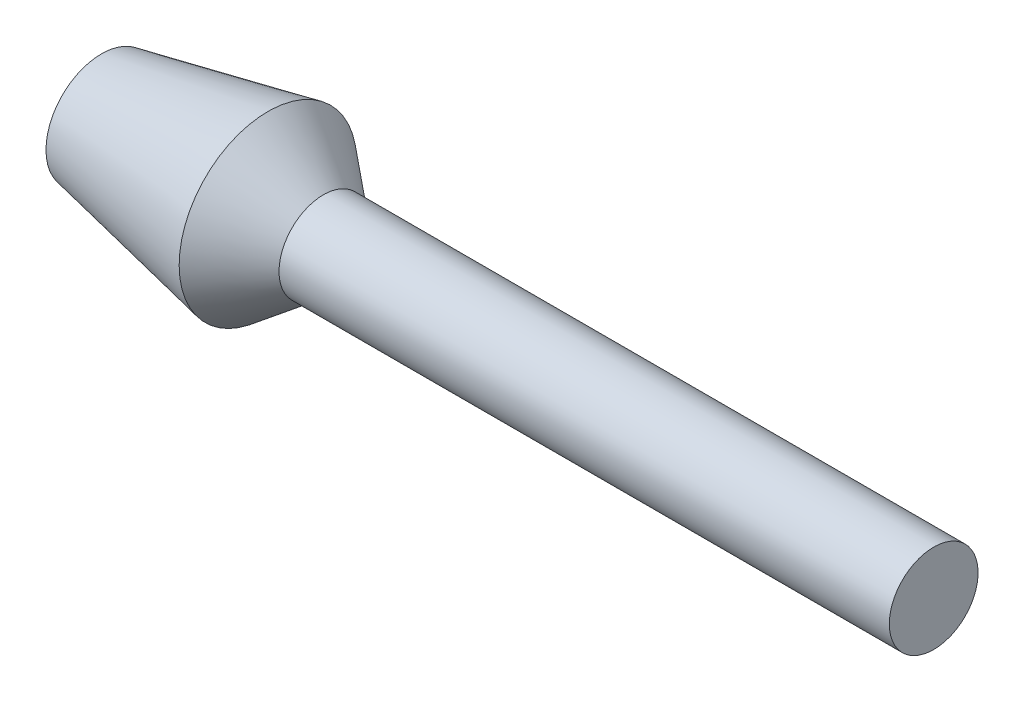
from build123d import *


with BuildPart() as part:
    # Sketch1 → Revolve1 (revolve)
    with BuildSketch(Plane.XY, mode=Mode.PRIVATE) as revolve1_sk:
        Polygon((-23.13253012, 0), (51.86746988, 0), (51.86746988, -4), (-3.13253012, -4), (-8.13253012, -8), (-23.13253012, -5), align=None)
    revolve(revolve1_sk.sketch.rotate(Axis((-23.13253012, 0, 0), (1, 0, 0)), 270), axis=Axis((-23.13253012, 0, 0), (1, 0, 0)))


solid = part.part
